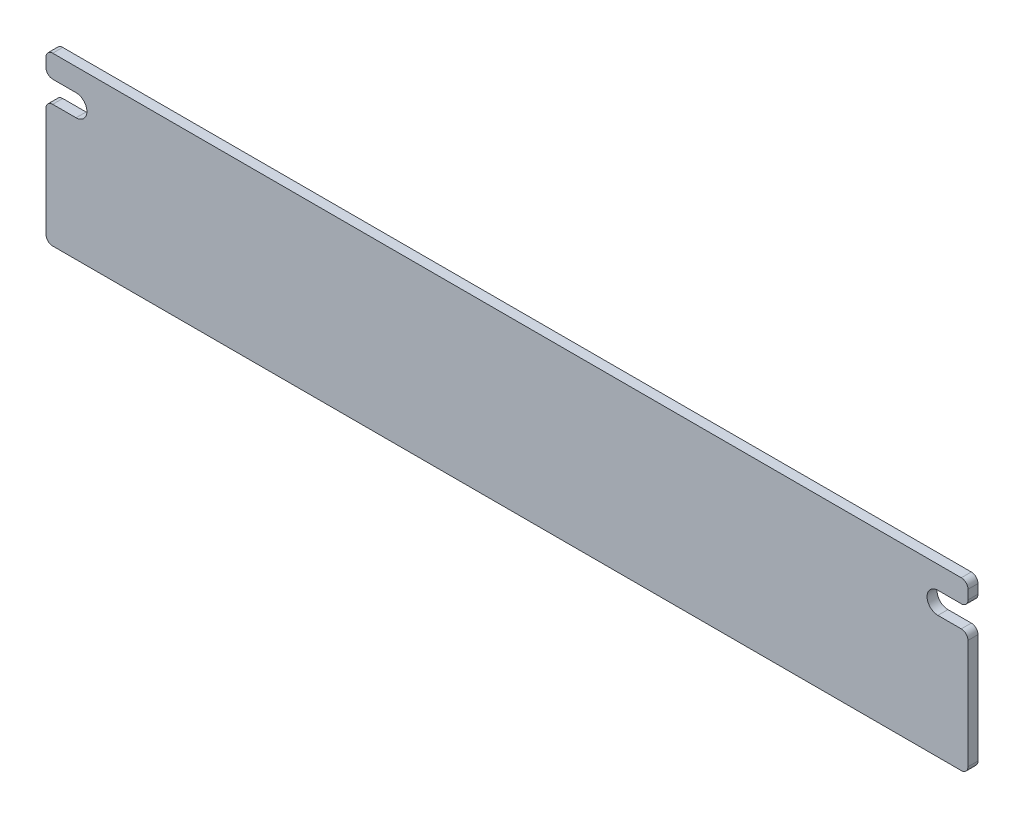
ISO-10303-21;
HEADER;
FILE_DESCRIPTION(('STEP AP214'),'2;1');
FILE_NAME('part.step','',(''),(''),'','','');
FILE_SCHEMA(('AUTOMOTIVE_DESIGN { 1 0 10303 214 1 1 1 1 }'));
ENDSEC;
DATA;
#1=APPLICATION_CONTEXT('core data for automotive mechanical design processes');
#2=APPLICATION_PROTOCOL_DEFINITION('international standard','automotive_design',2000,#1);
#3=PRODUCT_CONTEXT('',#1,'mechanical');
#4=PRODUCT('Part','Part','',(#3));
#5=PRODUCT_RELATED_PRODUCT_CATEGORY('part','',(#4));
#6=PRODUCT_DEFINITION_FORMATION('','',#4);
#7=PRODUCT_DEFINITION_CONTEXT('part definition',#1,'design');
#8=PRODUCT_DEFINITION('design','',#6,#7);
#9=PRODUCT_DEFINITION_SHAPE('','',#8);
#10=(LENGTH_UNIT() NAMED_UNIT(*) SI_UNIT(.MILLI.,.METRE.));
#11=(NAMED_UNIT(*) PLANE_ANGLE_UNIT() SI_UNIT($,.RADIAN.));
#12=(NAMED_UNIT(*) SI_UNIT($,.STERADIAN.) SOLID_ANGLE_UNIT());
#13=UNCERTAINTY_MEASURE_WITH_UNIT(LENGTH_MEASURE(1.E-05),#10,'distance_accuracy_value','');
#14=(GEOMETRIC_REPRESENTATION_CONTEXT(3) GLOBAL_UNCERTAINTY_ASSIGNED_CONTEXT((#13)) GLOBAL_UNIT_ASSIGNED_CONTEXT((#10,
#11,#12)) REPRESENTATION_CONTEXT('',''));
#15=CARTESIAN_POINT('',(0.,0.,0.));
#16=DIRECTION('',(0.,0.,1.));
#17=DIRECTION('',(1.,0.,0.));
#18=AXIS2_PLACEMENT_3D('',#15,#16,#17);
#19=CARTESIAN_POINT('',(-138.,25.,3.));
#20=DIRECTION('',(1.,0.,0.));
#21=DIRECTION('',(0.,0.,-1.));
#22=AXIS2_PLACEMENT_3D('',#19,#20,#21);
#23=PLANE('',#22);
#24=DIRECTION('',(0.,-1.,0.));
#25=VECTOR('',#24,1.);
#26=CARTESIAN_POINT('',(-138.,25.,0.));
#27=LINE('',#26,#25);
#28=CARTESIAN_POINT('',(-138.,23.,0.));
#29=VERTEX_POINT('',#28);
#30=CARTESIAN_POINT('',(-138.,20.25,0.));
#31=VERTEX_POINT('',#30);
#32=EDGE_CURVE('E176',#29,#31,#27,.T.);
#33=ORIENTED_EDGE('',*,*,#32,.T.);
#34=DIRECTION('',(0.,0.,-1.));
#35=VECTOR('',#34,1.);
#36=CARTESIAN_POINT('',(-138.,20.25,3.));
#37=LINE('',#36,#35);
#38=CARTESIAN_POINT('',(-138.,20.25,3.));
#39=VERTEX_POINT('',#38);
#40=EDGE_CURVE('E270',#31,#39,#37,.F.);
#41=ORIENTED_EDGE('',*,*,#40,.T.);
#42=DIRECTION('',(0.,-1.,0.));
#43=VECTOR('',#42,1.);
#44=CARTESIAN_POINT('',(-138.,25.,3.));
#45=LINE('',#44,#43);
#46=CARTESIAN_POINT('',(-138.,23.,3.));
#47=VERTEX_POINT('',#46);
#48=EDGE_CURVE('E214',#47,#39,#45,.T.);
#49=ORIENTED_EDGE('',*,*,#48,.F.);
#50=DIRECTION('',(0.,0.,-1.));
#51=VECTOR('',#50,1.);
#52=CARTESIAN_POINT('',(-138.,23.,3.));
#53=LINE('',#52,#51);
#54=EDGE_CURVE('E267',#47,#29,#53,.T.);
#55=ORIENTED_EDGE('',*,*,#54,.T.);
#56=EDGE_LOOP('',(#33,#41,#49,#55));
#57=FACE_BOUND('',#56,.T.);
#58=ADVANCED_FACE('F28',(#57),#23,.F.);
#59=CARTESIAN_POINT('',(-129.,18.2499999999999,3.));
#60=DIRECTION('',(0.,1.,0.));
#61=DIRECTION('',(-1.,0.,0.));
#62=AXIS2_PLACEMENT_3D('',#59,#60,#61);
#63=PLANE('',#62);
#64=DIRECTION('',(1.,0.,0.));
#65=VECTOR('',#64,1.);
#66=CARTESIAN_POINT('',(-129.,18.2499999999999,3.));
#67=LINE('',#66,#65);
#68=CARTESIAN_POINT('',(-136.,18.25,3.));
#69=VERTEX_POINT('',#68);
#70=CARTESIAN_POINT('',(-129.,18.25,3.));
#71=VERTEX_POINT('',#70);
#72=EDGE_CURVE('E217',#69,#71,#67,.T.);
#73=ORIENTED_EDGE('',*,*,#72,.F.);
#74=DIRECTION('',(0.,0.,-1.));
#75=VECTOR('',#74,1.);
#76=CARTESIAN_POINT('',(-136.,18.25,3.));
#77=LINE('',#76,#75);
#78=CARTESIAN_POINT('',(-136.,18.25,0.));
#79=VERTEX_POINT('',#78);
#80=EDGE_CURVE('E172',#69,#79,#77,.T.);
#81=ORIENTED_EDGE('',*,*,#80,.T.);
#82=DIRECTION('',(1.,0.,0.));
#83=VECTOR('',#82,1.);
#84=CARTESIAN_POINT('',(-129.,18.2499999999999,0.));
#85=LINE('',#84,#83);
#86=CARTESIAN_POINT('',(-129.,18.25,0.));
#87=VERTEX_POINT('',#86);
#88=EDGE_CURVE('E165',#79,#87,#85,.T.);
#89=ORIENTED_EDGE('',*,*,#88,.T.);
#90=DIRECTION('',(0.,0.,-1.));
#91=VECTOR('',#90,1.);
#92=CARTESIAN_POINT('',(-129.,18.25,3.));
#93=LINE('',#92,#91);
#94=EDGE_CURVE('E169',#71,#87,#93,.T.);
#95=ORIENTED_EDGE('',*,*,#94,.F.);
#96=EDGE_LOOP('',(#73,#81,#89,#95));
#97=FACE_BOUND('',#96,.T.);
#98=ADVANCED_FACE('F168',(#97),#63,.F.);
#99=CARTESIAN_POINT('',(-129.,15.,3.));
#100=DIRECTION('',(0.,0.,-1.));
#101=DIRECTION('',(-1.,0.,0.));
#102=AXIS2_PLACEMENT_3D('',#99,#100,#101);
#103=CYLINDRICAL_SURFACE('',#102,3.25);
#104=CARTESIAN_POINT('',(-129.,15.,0.));
#105=DIRECTION('',(0.,0.,-1.));
#106=DIRECTION('',(1.,0.,0.));
#107=AXIS2_PLACEMENT_3D('',#104,#105,#106);
#108=CIRCLE('',#107,3.25);
#109=CARTESIAN_POINT('',(-129.,11.7499999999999,0.));
#110=VERTEX_POINT('',#109);
#111=EDGE_CURVE('E175',#87,#110,#108,.T.);
#112=ORIENTED_EDGE('',*,*,#111,.T.);
#113=DIRECTION('',(0.,0.,-1.));
#114=VECTOR('',#113,1.);
#115=CARTESIAN_POINT('',(-129.,11.7499999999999,3.));
#116=LINE('',#115,#114);
#117=CARTESIAN_POINT('',(-129.,11.7499999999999,3.));
#118=VERTEX_POINT('',#117);
#119=EDGE_CURVE('E183',#118,#110,#116,.T.);
#120=ORIENTED_EDGE('',*,*,#119,.F.);
#121=CARTESIAN_POINT('',(-129.,15.,3.));
#122=DIRECTION('',(0.,0.,-1.));
#123=DIRECTION('',(1.,0.,0.));
#124=AXIS2_PLACEMENT_3D('',#121,#122,#123);
#125=CIRCLE('',#124,3.25);
#126=EDGE_CURVE('E182',#71,#118,#125,.T.);
#127=ORIENTED_EDGE('',*,*,#126,.F.);
#128=ORIENTED_EDGE('',*,*,#94,.T.);
#129=EDGE_LOOP('',(#112,#120,#127,#128));
#130=FACE_BOUND('',#129,.T.);
#131=ADVANCED_FACE('F179',(#130),#103,.F.);
#132=CARTESIAN_POINT('',(-129.,11.7499999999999,3.));
#133=DIRECTION('',(0.,-1.,0.));
#134=DIRECTION('',(1.,0.,0.));
#135=AXIS2_PLACEMENT_3D('',#132,#133,#134);
#136=PLANE('',#135);
#137=DIRECTION('',(-1.,0.,0.));
#138=VECTOR('',#137,1.);
#139=CARTESIAN_POINT('',(-129.,11.7499999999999,0.));
#140=LINE('',#139,#138);
#141=CARTESIAN_POINT('',(-136.,11.75,0.));
#142=VERTEX_POINT('',#141);
#143=EDGE_CURVE('E188',#110,#142,#140,.T.);
#144=ORIENTED_EDGE('',*,*,#143,.T.);
#145=DIRECTION('',(0.,0.,-1.));
#146=VECTOR('',#145,1.);
#147=CARTESIAN_POINT('',(-136.,11.75,3.));
#148=LINE('',#147,#146);
#149=CARTESIAN_POINT('',(-136.,11.75,3.));
#150=VERTEX_POINT('',#149);
#151=EDGE_CURVE('E304',#142,#150,#148,.F.);
#152=ORIENTED_EDGE('',*,*,#151,.T.);
#153=DIRECTION('',(-1.,0.,0.));
#154=VECTOR('',#153,1.);
#155=CARTESIAN_POINT('',(-129.,11.7499999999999,3.));
#156=LINE('',#155,#154);
#157=EDGE_CURVE('E220',#118,#150,#156,.T.);
#158=ORIENTED_EDGE('',*,*,#157,.F.);
#159=ORIENTED_EDGE('',*,*,#119,.T.);
#160=EDGE_LOOP('',(#144,#152,#158,#159));
#161=FACE_BOUND('',#160,.T.);
#162=ADVANCED_FACE('F350',(#161),#136,.F.);
#163=CARTESIAN_POINT('',(-138.,11.75,3.));
#164=DIRECTION('',(1.,0.,0.));
#165=DIRECTION('',(0.,0.,-1.));
#166=AXIS2_PLACEMENT_3D('',#163,#164,#165);
#167=PLANE('',#166);
#168=DIRECTION('',(0.,-1.,0.));
#169=VECTOR('',#168,1.);
#170=CARTESIAN_POINT('',(-138.,11.75,0.));
#171=LINE('',#170,#169);
#172=CARTESIAN_POINT('',(-138.,9.74999999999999,0.));
#173=VERTEX_POINT('',#172);
#174=CARTESIAN_POINT('',(-138.,-23.,0.));
#175=VERTEX_POINT('',#174);
#176=EDGE_CURVE('E190',#173,#175,#171,.T.);
#177=ORIENTED_EDGE('',*,*,#176,.T.);
#178=DIRECTION('',(0.,0.,-1.));
#179=VECTOR('',#178,1.);
#180=CARTESIAN_POINT('',(-138.,-23.,3.));
#181=LINE('',#180,#179);
#182=CARTESIAN_POINT('',(-138.,-23.,3.));
#183=VERTEX_POINT('',#182);
#184=EDGE_CURVE('E302',#175,#183,#181,.F.);
#185=ORIENTED_EDGE('',*,*,#184,.T.);
#186=DIRECTION('',(0.,-1.,0.));
#187=VECTOR('',#186,1.);
#188=CARTESIAN_POINT('',(-138.,11.75,3.));
#189=LINE('',#188,#187);
#190=CARTESIAN_POINT('',(-138.,9.74999999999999,3.));
#191=VERTEX_POINT('',#190);
#192=EDGE_CURVE('E223',#191,#183,#189,.T.);
#193=ORIENTED_EDGE('',*,*,#192,.F.);
#194=DIRECTION('',(0.,0.,-1.));
#195=VECTOR('',#194,1.);
#196=CARTESIAN_POINT('',(-138.,9.74999999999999,3.));
#197=LINE('',#196,#195);
#198=EDGE_CURVE('E299',#191,#173,#197,.T.);
#199=ORIENTED_EDGE('',*,*,#198,.T.);
#200=EDGE_LOOP('',(#177,#185,#193,#199));
#201=FACE_BOUND('',#200,.T.);
#202=ADVANCED_FACE('F355',(#201),#167,.F.);
#203=CARTESIAN_POINT('',(-138.,-25.,3.));
#204=DIRECTION('',(0.,1.,0.));
#205=DIRECTION('',(-1.,0.,0.));
#206=AXIS2_PLACEMENT_3D('',#203,#204,#205);
#207=PLANE('',#206);
#208=DIRECTION('',(1.,0.,0.));
#209=VECTOR('',#208,1.);
#210=CARTESIAN_POINT('',(-138.,-25.,3.));
#211=LINE('',#210,#209);
#212=CARTESIAN_POINT('',(-136.,-25.,3.));
#213=VERTEX_POINT('',#212);
#214=CARTESIAN_POINT('',(136.,-25.,3.));
#215=VERTEX_POINT('',#214);
#216=EDGE_CURVE('E226',#213,#215,#211,.T.);
#217=ORIENTED_EDGE('',*,*,#216,.F.);
#218=DIRECTION('',(0.,0.,-1.));
#219=VECTOR('',#218,1.);
#220=CARTESIAN_POINT('',(-136.,-25.,3.));
#221=LINE('',#220,#219);
#222=CARTESIAN_POINT('',(-136.,-25.,0.));
#223=VERTEX_POINT('',#222);
#224=EDGE_CURVE('E296',#213,#223,#221,.T.);
#225=ORIENTED_EDGE('',*,*,#224,.T.);
#226=DIRECTION('',(1.,0.,0.));
#227=VECTOR('',#226,1.);
#228=CARTESIAN_POINT('',(-138.,-25.,0.));
#229=LINE('',#228,#227);
#230=CARTESIAN_POINT('',(136.,-25.,0.));
#231=VERTEX_POINT('',#230);
#232=EDGE_CURVE('E196',#223,#231,#229,.T.);
#233=ORIENTED_EDGE('',*,*,#232,.T.);
#234=DIRECTION('',(0.,0.,-1.));
#235=VECTOR('',#234,1.);
#236=CARTESIAN_POINT('',(136.,-25.,3.));
#237=LINE('',#236,#235);
#238=EDGE_CURVE('E294',#231,#215,#237,.F.);
#239=ORIENTED_EDGE('',*,*,#238,.T.);
#240=EDGE_LOOP('',(#217,#225,#233,#239));
#241=FACE_BOUND('',#240,.T.);
#242=ADVANCED_FACE('F359',(#241),#207,.F.);
#243=CARTESIAN_POINT('',(138.,11.75,3.));
#244=DIRECTION('',(-1.,0.,0.));
#245=DIRECTION('',(0.,0.,1.));
#246=AXIS2_PLACEMENT_3D('',#243,#244,#245);
#247=PLANE('',#246);
#248=DIRECTION('',(0.,1.,0.));
#249=VECTOR('',#248,1.);
#250=CARTESIAN_POINT('',(138.,11.75,3.));
#251=LINE('',#250,#249);
#252=CARTESIAN_POINT('',(138.,-23.,3.));
#253=VERTEX_POINT('',#252);
#254=CARTESIAN_POINT('',(138.,9.74999999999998,3.));
#255=VERTEX_POINT('',#254);
#256=EDGE_CURVE('E229',#253,#255,#251,.T.);
#257=ORIENTED_EDGE('',*,*,#256,.F.);
#258=DIRECTION('',(0.,0.,-1.));
#259=VECTOR('',#258,1.);
#260=CARTESIAN_POINT('',(138.,-23.,3.));
#261=LINE('',#260,#259);
#262=CARTESIAN_POINT('',(138.,-23.,0.));
#263=VERTEX_POINT('',#262);
#264=EDGE_CURVE('E308',#253,#263,#261,.T.);
#265=ORIENTED_EDGE('',*,*,#264,.T.);
#266=DIRECTION('',(0.,1.,0.));
#267=VECTOR('',#266,1.);
#268=CARTESIAN_POINT('',(138.,11.75,0.));
#269=LINE('',#268,#267);
#270=CARTESIAN_POINT('',(138.,9.74999999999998,0.));
#271=VERTEX_POINT('',#270);
#272=EDGE_CURVE('E199',#263,#271,#269,.T.);
#273=ORIENTED_EDGE('',*,*,#272,.T.);
#274=DIRECTION('',(0.,0.,-1.));
#275=VECTOR('',#274,1.);
#276=CARTESIAN_POINT('',(138.,9.74999999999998,3.));
#277=LINE('',#276,#275);
#278=EDGE_CURVE('E306',#271,#255,#277,.F.);
#279=ORIENTED_EDGE('',*,*,#278,.T.);
#280=EDGE_LOOP('',(#257,#265,#273,#279));
#281=FACE_BOUND('',#280,.T.);
#282=ADVANCED_FACE('F363',(#281),#247,.F.);
#283=CARTESIAN_POINT('',(129.,11.75,3.));
#284=DIRECTION('',(0.,-1.,0.));
#285=DIRECTION('',(1.,0.,0.));
#286=AXIS2_PLACEMENT_3D('',#283,#284,#285);
#287=PLANE('',#286);
#288=DIRECTION('',(-1.,0.,0.));
#289=VECTOR('',#288,1.);
#290=CARTESIAN_POINT('',(129.,11.75,3.));
#291=LINE('',#290,#289);
#292=CARTESIAN_POINT('',(136.,11.75,3.));
#293=VERTEX_POINT('',#292);
#294=CARTESIAN_POINT('',(129.,11.75,3.));
#295=VERTEX_POINT('',#294);
#296=EDGE_CURVE('E232',#293,#295,#291,.T.);
#297=ORIENTED_EDGE('',*,*,#296,.F.);
#298=DIRECTION('',(0.,0.,-1.));
#299=VECTOR('',#298,1.);
#300=CARTESIAN_POINT('',(136.,11.75,3.));
#301=LINE('',#300,#299);
#302=CARTESIAN_POINT('',(136.,11.75,0.));
#303=VERTEX_POINT('',#302);
#304=EDGE_CURVE('E311',#293,#303,#301,.T.);
#305=ORIENTED_EDGE('',*,*,#304,.T.);
#306=DIRECTION('',(-1.,0.,0.));
#307=VECTOR('',#306,1.);
#308=CARTESIAN_POINT('',(129.,11.75,0.));
#309=LINE('',#308,#307);
#310=CARTESIAN_POINT('',(129.,11.75,0.));
#311=VERTEX_POINT('',#310);
#312=EDGE_CURVE('E202',#303,#311,#309,.T.);
#313=ORIENTED_EDGE('',*,*,#312,.T.);
#314=DIRECTION('',(0.,0.,-1.));
#315=VECTOR('',#314,1.);
#316=CARTESIAN_POINT('',(129.,11.75,3.));
#317=LINE('',#316,#315);
#318=EDGE_CURVE('E246',#295,#311,#317,.T.);
#319=ORIENTED_EDGE('',*,*,#318,.F.);
#320=EDGE_LOOP('',(#297,#305,#313,#319));
#321=FACE_BOUND('',#320,.T.);
#322=ADVANCED_FACE('F367',(#321),#287,.F.);
#323=CARTESIAN_POINT('',(129.,15.,3.));
#324=DIRECTION('',(0.,0.,-1.));
#325=DIRECTION('',(-1.,0.,0.));
#326=AXIS2_PLACEMENT_3D('',#323,#324,#325);
#327=CYLINDRICAL_SURFACE('',#326,3.25);
#328=CARTESIAN_POINT('',(129.,15.,0.));
#329=DIRECTION('',(0.,0.,-1.));
#330=DIRECTION('',(1.,0.,0.));
#331=AXIS2_PLACEMENT_3D('',#328,#329,#330);
#332=CIRCLE('',#331,3.25);
#333=CARTESIAN_POINT('',(129.,18.25,0.));
#334=VERTEX_POINT('',#333);
#335=EDGE_CURVE('E204',#311,#334,#332,.T.);
#336=ORIENTED_EDGE('',*,*,#335,.T.);
#337=DIRECTION('',(0.,0.,-1.));
#338=VECTOR('',#337,1.);
#339=CARTESIAN_POINT('',(129.,18.25,3.));
#340=LINE('',#339,#338);
#341=CARTESIAN_POINT('',(129.,18.25,3.));
#342=VERTEX_POINT('',#341);
#343=EDGE_CURVE('E243',#342,#334,#340,.T.);
#344=ORIENTED_EDGE('',*,*,#343,.F.);
#345=CARTESIAN_POINT('',(129.,15.,3.));
#346=DIRECTION('',(0.,0.,-1.));
#347=DIRECTION('',(1.,0.,0.));
#348=AXIS2_PLACEMENT_3D('',#345,#346,#347);
#349=CIRCLE('',#348,3.25);
#350=EDGE_CURVE('E234',#295,#342,#349,.T.);
#351=ORIENTED_EDGE('',*,*,#350,.F.);
#352=ORIENTED_EDGE('',*,*,#318,.T.);
#353=EDGE_LOOP('',(#336,#344,#351,#352));
#354=FACE_BOUND('',#353,.T.);
#355=ADVANCED_FACE('F371',(#354),#327,.F.);
#356=CARTESIAN_POINT('',(129.,18.25,3.));
#357=DIRECTION('',(0.,1.,0.));
#358=DIRECTION('',(-1.,0.,0.));
#359=AXIS2_PLACEMENT_3D('',#356,#357,#358);
#360=PLANE('',#359);
#361=DIRECTION('',(1.,0.,0.));
#362=VECTOR('',#361,1.);
#363=CARTESIAN_POINT('',(129.,18.25,0.));
#364=LINE('',#363,#362);
#365=CARTESIAN_POINT('',(136.,18.25,0.));
#366=VERTEX_POINT('',#365);
#367=EDGE_CURVE('E206',#334,#366,#364,.T.);
#368=ORIENTED_EDGE('',*,*,#367,.T.);
#369=DIRECTION('',(0.,0.,-1.));
#370=VECTOR('',#369,1.);
#371=CARTESIAN_POINT('',(136.,18.25,3.));
#372=LINE('',#371,#370);
#373=CARTESIAN_POINT('',(136.,18.25,3.));
#374=VERTEX_POINT('',#373);
#375=EDGE_CURVE('E292',#366,#374,#372,.F.);
#376=ORIENTED_EDGE('',*,*,#375,.T.);
#377=DIRECTION('',(1.,0.,0.));
#378=VECTOR('',#377,1.);
#379=CARTESIAN_POINT('',(129.,18.25,3.));
#380=LINE('',#379,#378);
#381=EDGE_CURVE('E236',#342,#374,#380,.T.);
#382=ORIENTED_EDGE('',*,*,#381,.F.);
#383=ORIENTED_EDGE('',*,*,#343,.T.);
#384=EDGE_LOOP('',(#368,#376,#382,#383));
#385=FACE_BOUND('',#384,.T.);
#386=ADVANCED_FACE('F375',(#385),#360,.F.);
#387=CARTESIAN_POINT('',(138.,25.,3.));
#388=DIRECTION('',(-1.,0.,0.));
#389=DIRECTION('',(0.,0.,1.));
#390=AXIS2_PLACEMENT_3D('',#387,#388,#389);
#391=PLANE('',#390);
#392=DIRECTION('',(0.,1.,0.));
#393=VECTOR('',#392,1.);
#394=CARTESIAN_POINT('',(138.,25.,3.));
#395=LINE('',#394,#393);
#396=CARTESIAN_POINT('',(138.,20.25,3.));
#397=VERTEX_POINT('',#396);
#398=CARTESIAN_POINT('',(138.,23.,3.));
#399=VERTEX_POINT('',#398);
#400=EDGE_CURVE('E239',#397,#399,#395,.T.);
#401=ORIENTED_EDGE('',*,*,#400,.F.);
#402=DIRECTION('',(0.,0.,-1.));
#403=VECTOR('',#402,1.);
#404=CARTESIAN_POINT('',(138.,20.25,3.));
#405=LINE('',#404,#403);
#406=CARTESIAN_POINT('',(138.,20.25,0.));
#407=VERTEX_POINT('',#406);
#408=EDGE_CURVE('E289',#397,#407,#405,.T.);
#409=ORIENTED_EDGE('',*,*,#408,.T.);
#410=DIRECTION('',(0.,1.,0.));
#411=VECTOR('',#410,1.);
#412=CARTESIAN_POINT('',(138.,25.,0.));
#413=LINE('',#412,#411);
#414=CARTESIAN_POINT('',(138.,23.,0.));
#415=VERTEX_POINT('',#414);
#416=EDGE_CURVE('E209',#407,#415,#413,.T.);
#417=ORIENTED_EDGE('',*,*,#416,.T.);
#418=DIRECTION('',(0.,0.,-1.));
#419=VECTOR('',#418,1.);
#420=CARTESIAN_POINT('',(138.,23.,3.));
#421=LINE('',#420,#419);
#422=EDGE_CURVE('E287',#415,#399,#421,.F.);
#423=ORIENTED_EDGE('',*,*,#422,.T.);
#424=EDGE_LOOP('',(#401,#409,#417,#423));
#425=FACE_BOUND('',#424,.T.);
#426=ADVANCED_FACE('F379',(#425),#391,.F.);
#427=CARTESIAN_POINT('',(-138.,25.,3.));
#428=DIRECTION('',(0.,-1.,0.));
#429=DIRECTION('',(1.,0.,0.));
#430=AXIS2_PLACEMENT_3D('',#427,#428,#429);
#431=PLANE('',#430);
#432=DIRECTION('',(-1.,0.,0.));
#433=VECTOR('',#432,1.);
#434=CARTESIAN_POINT('',(-138.,25.,0.));
#435=LINE('',#434,#433);
#436=CARTESIAN_POINT('',(136.,25.,0.));
#437=VERTEX_POINT('',#436);
#438=CARTESIAN_POINT('',(-136.,25.,0.));
#439=VERTEX_POINT('',#438);
#440=EDGE_CURVE('E212',#437,#439,#435,.T.);
#441=ORIENTED_EDGE('',*,*,#440,.T.);
#442=DIRECTION('',(0.,0.,-1.));
#443=VECTOR('',#442,1.);
#444=CARTESIAN_POINT('',(-136.,25.,3.));
#445=LINE('',#444,#443);
#446=CARTESIAN_POINT('',(-136.,25.,3.));
#447=VERTEX_POINT('',#446);
#448=EDGE_CURVE('E11',#439,#447,#445,.F.);
#449=ORIENTED_EDGE('',*,*,#448,.T.);
#450=DIRECTION('',(-1.,0.,0.));
#451=VECTOR('',#450,1.);
#452=CARTESIAN_POINT('',(-138.,25.,3.));
#453=LINE('',#452,#451);
#454=CARTESIAN_POINT('',(136.,25.,3.));
#455=VERTEX_POINT('',#454);
#456=EDGE_CURVE('E241',#455,#447,#453,.T.);
#457=ORIENTED_EDGE('',*,*,#456,.F.);
#458=DIRECTION('',(0.,0.,-1.));
#459=VECTOR('',#458,1.);
#460=CARTESIAN_POINT('',(136.,25.,3.));
#461=LINE('',#460,#459);
#462=EDGE_CURVE('E35',#455,#437,#461,.T.);
#463=ORIENTED_EDGE('',*,*,#462,.T.);
#464=EDGE_LOOP('',(#441,#449,#457,#463));
#465=FACE_BOUND('',#464,.T.);
#466=ADVANCED_FACE('F316',(#465),#431,.F.);
#467=CARTESIAN_POINT('',(-129.,15.,3.));
#468=DIRECTION('',(0.,0.,1.));
#469=DIRECTION('',(1.,0.,0.));
#470=AXIS2_PLACEMENT_3D('',#467,#468,#469);
#471=PLANE('',#470);
#472=ORIENTED_EDGE('',*,*,#48,.T.);
#473=CARTESIAN_POINT('',(-136.,20.25,3.));
#474=DIRECTION('',(0.,0.,1.));
#475=DIRECTION('',(1.,0.,0.));
#476=AXIS2_PLACEMENT_3D('',#473,#474,#475);
#477=CIRCLE('',#476,2.);
#478=EDGE_CURVE('E285',#39,#69,#477,.T.);
#479=ORIENTED_EDGE('',*,*,#478,.T.);
#480=ORIENTED_EDGE('',*,*,#72,.T.);
#481=ORIENTED_EDGE('',*,*,#126,.T.);
#482=ORIENTED_EDGE('',*,*,#157,.T.);
#483=CARTESIAN_POINT('',(-136.,9.74999999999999,3.));
#484=DIRECTION('',(0.,0.,1.));
#485=DIRECTION('',(1.,0.,0.));
#486=AXIS2_PLACEMENT_3D('',#483,#484,#485);
#487=CIRCLE('',#486,2.);
#488=EDGE_CURVE('E279',#150,#191,#487,.T.);
#489=ORIENTED_EDGE('',*,*,#488,.T.);
#490=ORIENTED_EDGE('',*,*,#192,.T.);
#491=CARTESIAN_POINT('',(-136.,-23.,3.));
#492=DIRECTION('',(0.,0.,1.));
#493=DIRECTION('',(1.,0.,0.));
#494=AXIS2_PLACEMENT_3D('',#491,#492,#493);
#495=CIRCLE('',#494,2.);
#496=EDGE_CURVE('E281',#183,#213,#495,.T.);
#497=ORIENTED_EDGE('',*,*,#496,.T.);
#498=ORIENTED_EDGE('',*,*,#216,.T.);
#499=CARTESIAN_POINT('',(136.,-23.,3.));
#500=DIRECTION('',(0.,0.,1.));
#501=DIRECTION('',(1.,0.,0.));
#502=AXIS2_PLACEMENT_3D('',#499,#500,#501);
#503=CIRCLE('',#502,2.);
#504=EDGE_CURVE('E277',#215,#253,#503,.T.);
#505=ORIENTED_EDGE('',*,*,#504,.T.);
#506=ORIENTED_EDGE('',*,*,#256,.T.);
#507=CARTESIAN_POINT('',(136.,9.74999999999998,3.));
#508=DIRECTION('',(0.,0.,1.));
#509=DIRECTION('',(1.,0.,0.));
#510=AXIS2_PLACEMENT_3D('',#507,#508,#509);
#511=CIRCLE('',#510,2.);
#512=EDGE_CURVE('E275',#255,#293,#511,.T.);
#513=ORIENTED_EDGE('',*,*,#512,.T.);
#514=ORIENTED_EDGE('',*,*,#296,.T.);
#515=ORIENTED_EDGE('',*,*,#350,.T.);
#516=ORIENTED_EDGE('',*,*,#381,.T.);
#517=CARTESIAN_POINT('',(136.,20.25,3.));
#518=DIRECTION('',(0.,0.,1.));
#519=DIRECTION('',(1.,0.,0.));
#520=AXIS2_PLACEMENT_3D('',#517,#518,#519);
#521=CIRCLE('',#520,2.);
#522=EDGE_CURVE('E283',#374,#397,#521,.T.);
#523=ORIENTED_EDGE('',*,*,#522,.T.);
#524=ORIENTED_EDGE('',*,*,#400,.T.);
#525=CARTESIAN_POINT('',(136.,23.,3.));
#526=DIRECTION('',(0.,0.,1.));
#527=DIRECTION('',(1.,0.,0.));
#528=AXIS2_PLACEMENT_3D('',#525,#526,#527);
#529=CIRCLE('',#528,2.);
#530=EDGE_CURVE('E47',#399,#455,#529,.T.);
#531=ORIENTED_EDGE('',*,*,#530,.T.);
#532=ORIENTED_EDGE('',*,*,#456,.T.);
#533=CARTESIAN_POINT('',(-136.,23.,3.));
#534=DIRECTION('',(0.,0.,1.));
#535=DIRECTION('',(1.,0.,0.));
#536=AXIS2_PLACEMENT_3D('',#533,#534,#535);
#537=CIRCLE('',#536,2.);
#538=EDGE_CURVE('E273',#447,#47,#537,.T.);
#539=ORIENTED_EDGE('',*,*,#538,.T.);
#540=EDGE_LOOP('',(#472,#479,#480,#481,#482,#489,#490,#497,#498,#505,#506,#513,#514,#515,#516,
#523,#524,#531,#532,#539));
#541=FACE_BOUND('',#540,.T.);
#542=ADVANCED_FACE('F329',(#541),#471,.T.);
#543=CARTESIAN_POINT('',(-129.,15.,0.));
#544=DIRECTION('',(0.,0.,1.));
#545=DIRECTION('',(1.,0.,0.));
#546=AXIS2_PLACEMENT_3D('',#543,#544,#545);
#547=PLANE('',#546);
#548=ORIENTED_EDGE('',*,*,#88,.F.);
#549=CARTESIAN_POINT('',(-136.,20.25,0.));
#550=DIRECTION('',(0.,0.,1.));
#551=DIRECTION('',(1.,0.,0.));
#552=AXIS2_PLACEMENT_3D('',#549,#550,#551);
#553=CIRCLE('',#552,2.);
#554=EDGE_CURVE('E265',#79,#31,#553,.F.);
#555=ORIENTED_EDGE('',*,*,#554,.T.);
#556=ORIENTED_EDGE('',*,*,#32,.F.);
#557=CARTESIAN_POINT('',(-136.,23.,0.));
#558=DIRECTION('',(0.,0.,1.));
#559=DIRECTION('',(1.,0.,0.));
#560=AXIS2_PLACEMENT_3D('',#557,#558,#559);
#561=CIRCLE('',#560,2.);
#562=EDGE_CURVE('E253',#29,#439,#561,.F.);
#563=ORIENTED_EDGE('',*,*,#562,.T.);
#564=ORIENTED_EDGE('',*,*,#440,.F.);
#565=CARTESIAN_POINT('',(136.,23.,0.));
#566=DIRECTION('',(0.,0.,1.));
#567=DIRECTION('',(1.,0.,0.));
#568=AXIS2_PLACEMENT_3D('',#565,#566,#567);
#569=CIRCLE('',#568,2.);
#570=EDGE_CURVE('E251',#437,#415,#569,.F.);
#571=ORIENTED_EDGE('',*,*,#570,.T.);
#572=ORIENTED_EDGE('',*,*,#416,.F.);
#573=CARTESIAN_POINT('',(136.,20.25,0.));
#574=DIRECTION('',(0.,0.,1.));
#575=DIRECTION('',(1.,0.,0.));
#576=AXIS2_PLACEMENT_3D('',#573,#574,#575);
#577=CIRCLE('',#576,2.);
#578=EDGE_CURVE('E263',#407,#366,#577,.F.);
#579=ORIENTED_EDGE('',*,*,#578,.T.);
#580=ORIENTED_EDGE('',*,*,#367,.F.);
#581=ORIENTED_EDGE('',*,*,#335,.F.);
#582=ORIENTED_EDGE('',*,*,#312,.F.);
#583=CARTESIAN_POINT('',(136.,9.74999999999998,0.));
#584=DIRECTION('',(0.,0.,1.));
#585=DIRECTION('',(1.,0.,0.));
#586=AXIS2_PLACEMENT_3D('',#583,#584,#585);
#587=CIRCLE('',#586,2.);
#588=EDGE_CURVE('E255',#303,#271,#587,.F.);
#589=ORIENTED_EDGE('',*,*,#588,.T.);
#590=ORIENTED_EDGE('',*,*,#272,.F.);
#591=CARTESIAN_POINT('',(136.,-23.,0.));
#592=DIRECTION('',(0.,0.,1.));
#593=DIRECTION('',(1.,0.,0.));
#594=AXIS2_PLACEMENT_3D('',#591,#592,#593);
#595=CIRCLE('',#594,2.);
#596=EDGE_CURVE('E257',#263,#231,#595,.F.);
#597=ORIENTED_EDGE('',*,*,#596,.T.);
#598=ORIENTED_EDGE('',*,*,#232,.F.);
#599=CARTESIAN_POINT('',(-136.,-23.,0.));
#600=DIRECTION('',(0.,0.,1.));
#601=DIRECTION('',(1.,0.,0.));
#602=AXIS2_PLACEMENT_3D('',#599,#600,#601);
#603=CIRCLE('',#602,2.);
#604=EDGE_CURVE('E261',#223,#175,#603,.F.);
#605=ORIENTED_EDGE('',*,*,#604,.T.);
#606=ORIENTED_EDGE('',*,*,#176,.F.);
#607=CARTESIAN_POINT('',(-136.,9.74999999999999,0.));
#608=DIRECTION('',(0.,0.,1.));
#609=DIRECTION('',(1.,0.,0.));
#610=AXIS2_PLACEMENT_3D('',#607,#608,#609);
#611=CIRCLE('',#610,2.);
#612=EDGE_CURVE('E259',#173,#142,#611,.F.);
#613=ORIENTED_EDGE('',*,*,#612,.T.);
#614=ORIENTED_EDGE('',*,*,#143,.F.);
#615=ORIENTED_EDGE('',*,*,#111,.F.);
#616=EDGE_LOOP('',(#548,#555,#556,#563,#564,#571,#572,#579,#580,#581,#582,#589,#590,#597,#598,
#605,#606,#613,#614,#615));
#617=FACE_BOUND('',#616,.T.);
#618=ADVANCED_FACE('F186',(#617),#547,.F.);
#619=CARTESIAN_POINT('',(-136.,20.25,3.));
#620=DIRECTION('',(0.,0.,-1.));
#621=DIRECTION('',(-1.,0.,0.));
#622=AXIS2_PLACEMENT_3D('',#619,#620,#621);
#623=CYLINDRICAL_SURFACE('',#622,2.);
#624=ORIENTED_EDGE('',*,*,#478,.F.);
#625=ORIENTED_EDGE('',*,*,#40,.F.);
#626=ORIENTED_EDGE('',*,*,#554,.F.);
#627=ORIENTED_EDGE('',*,*,#80,.F.);
#628=EDGE_LOOP('',(#624,#625,#626,#627));
#629=FACE_BOUND('',#628,.T.);
#630=ADVANCED_FACE('F331',(#629),#623,.T.);
#631=CARTESIAN_POINT('',(136.,20.25,3.));
#632=DIRECTION('',(0.,0.,-1.));
#633=DIRECTION('',(-1.,0.,0.));
#634=AXIS2_PLACEMENT_3D('',#631,#632,#633);
#635=CYLINDRICAL_SURFACE('',#634,2.);
#636=ORIENTED_EDGE('',*,*,#522,.F.);
#637=ORIENTED_EDGE('',*,*,#375,.F.);
#638=ORIENTED_EDGE('',*,*,#578,.F.);
#639=ORIENTED_EDGE('',*,*,#408,.F.);
#640=EDGE_LOOP('',(#636,#637,#638,#639));
#641=FACE_BOUND('',#640,.T.);
#642=ADVANCED_FACE('F333',(#641),#635,.T.);
#643=CARTESIAN_POINT('',(-136.,-23.,3.));
#644=DIRECTION('',(0.,0.,-1.));
#645=DIRECTION('',(-1.,0.,0.));
#646=AXIS2_PLACEMENT_3D('',#643,#644,#645);
#647=CYLINDRICAL_SURFACE('',#646,2.);
#648=ORIENTED_EDGE('',*,*,#496,.F.);
#649=ORIENTED_EDGE('',*,*,#184,.F.);
#650=ORIENTED_EDGE('',*,*,#604,.F.);
#651=ORIENTED_EDGE('',*,*,#224,.F.);
#652=EDGE_LOOP('',(#648,#649,#650,#651));
#653=FACE_BOUND('',#652,.T.);
#654=ADVANCED_FACE('F339',(#653),#647,.T.);
#655=CARTESIAN_POINT('',(-136.,9.74999999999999,3.));
#656=DIRECTION('',(0.,0.,-1.));
#657=DIRECTION('',(-1.,0.,0.));
#658=AXIS2_PLACEMENT_3D('',#655,#656,#657);
#659=CYLINDRICAL_SURFACE('',#658,2.);
#660=ORIENTED_EDGE('',*,*,#488,.F.);
#661=ORIENTED_EDGE('',*,*,#151,.F.);
#662=ORIENTED_EDGE('',*,*,#612,.F.);
#663=ORIENTED_EDGE('',*,*,#198,.F.);
#664=EDGE_LOOP('',(#660,#661,#662,#663));
#665=FACE_BOUND('',#664,.T.);
#666=ADVANCED_FACE('F413',(#665),#659,.T.);
#667=CARTESIAN_POINT('',(136.,-23.,3.));
#668=DIRECTION('',(0.,0.,-1.));
#669=DIRECTION('',(-1.,0.,0.));
#670=AXIS2_PLACEMENT_3D('',#667,#668,#669);
#671=CYLINDRICAL_SURFACE('',#670,2.);
#672=ORIENTED_EDGE('',*,*,#504,.F.);
#673=ORIENTED_EDGE('',*,*,#238,.F.);
#674=ORIENTED_EDGE('',*,*,#596,.F.);
#675=ORIENTED_EDGE('',*,*,#264,.F.);
#676=EDGE_LOOP('',(#672,#673,#674,#675));
#677=FACE_BOUND('',#676,.T.);
#678=ADVANCED_FACE('F421',(#677),#671,.T.);
#679=CARTESIAN_POINT('',(136.,9.74999999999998,3.));
#680=DIRECTION('',(0.,0.,-1.));
#681=DIRECTION('',(-1.,0.,0.));
#682=AXIS2_PLACEMENT_3D('',#679,#680,#681);
#683=CYLINDRICAL_SURFACE('',#682,2.);
#684=ORIENTED_EDGE('',*,*,#512,.F.);
#685=ORIENTED_EDGE('',*,*,#278,.F.);
#686=ORIENTED_EDGE('',*,*,#588,.F.);
#687=ORIENTED_EDGE('',*,*,#304,.F.);
#688=EDGE_LOOP('',(#684,#685,#686,#687));
#689=FACE_BOUND('',#688,.T.);
#690=ADVANCED_FACE('F429',(#689),#683,.T.);
#691=CARTESIAN_POINT('',(-136.,23.,3.));
#692=DIRECTION('',(0.,0.,-1.));
#693=DIRECTION('',(-1.,0.,0.));
#694=AXIS2_PLACEMENT_3D('',#691,#692,#693);
#695=CYLINDRICAL_SURFACE('',#694,2.);
#696=ORIENTED_EDGE('',*,*,#538,.F.);
#697=ORIENTED_EDGE('',*,*,#448,.F.);
#698=ORIENTED_EDGE('',*,*,#562,.F.);
#699=ORIENTED_EDGE('',*,*,#54,.F.);
#700=EDGE_LOOP('',(#696,#697,#698,#699));
#701=FACE_BOUND('',#700,.T.);
#702=ADVANCED_FACE('F324',(#701),#695,.T.);
#703=CARTESIAN_POINT('',(136.,23.,3.));
#704=DIRECTION('',(0.,0.,-1.));
#705=DIRECTION('',(-1.,0.,0.));
#706=AXIS2_PLACEMENT_3D('',#703,#704,#705);
#707=CYLINDRICAL_SURFACE('',#706,2.);
#708=ORIENTED_EDGE('',*,*,#530,.F.);
#709=ORIENTED_EDGE('',*,*,#422,.F.);
#710=ORIENTED_EDGE('',*,*,#570,.F.);
#711=ORIENTED_EDGE('',*,*,#462,.F.);
#712=EDGE_LOOP('',(#708,#709,#710,#711));
#713=FACE_BOUND('',#712,.T.);
#714=ADVANCED_FACE('F444',(#713),#707,.T.);
#715=CLOSED_SHELL('',(#58,#98,#131,#162,#202,#242,#282,#322,#355,#386,#426,#466,#542,#618,#630,
#642,#654,#666,#678,#690,#702,#714));
#716=MANIFOLD_SOLID_BREP('B2',#715);
#717=ADVANCED_BREP_SHAPE_REPRESENTATION('',(#18,#716),#14);
#718=SHAPE_DEFINITION_REPRESENTATION(#9,#717);
ENDSEC;
END-ISO-10303-21;
